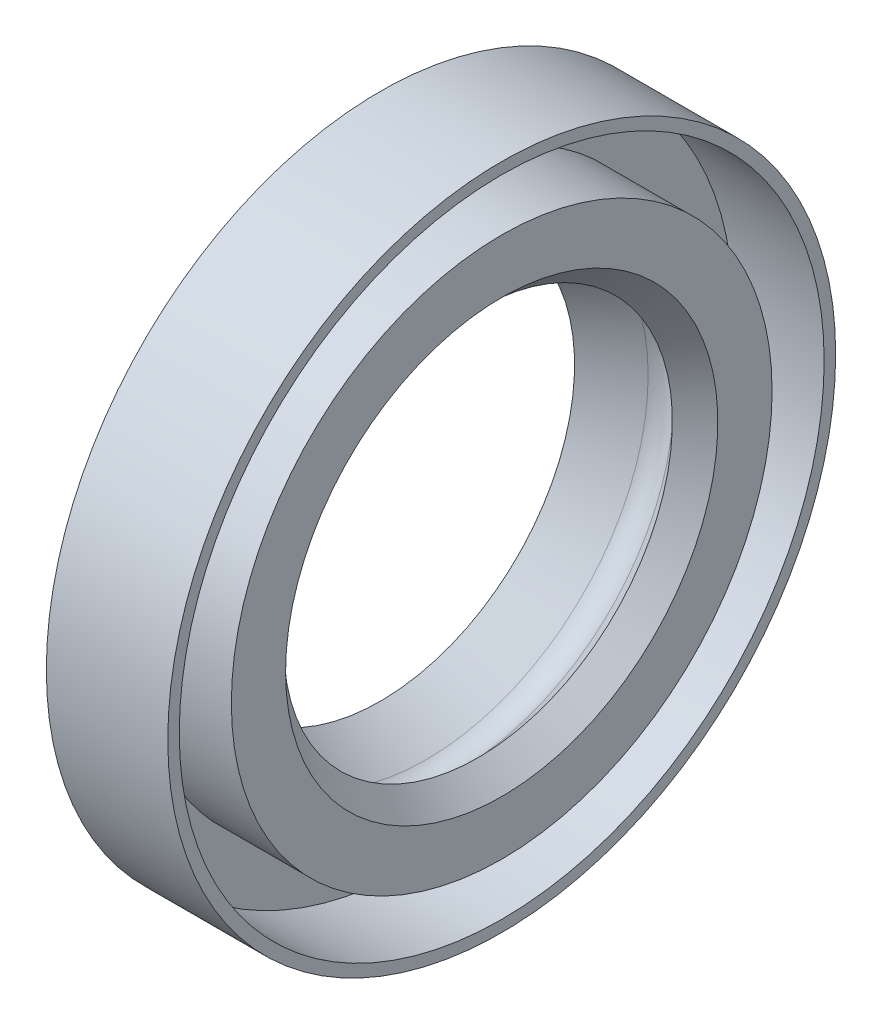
ISO-10303-21;
HEADER;
FILE_DESCRIPTION(('STEP AP214'),'2;1');
FILE_NAME('part.step','',(''),(''),'','','');
FILE_SCHEMA(('AUTOMOTIVE_DESIGN { 1 0 10303 214 1 1 1 1 }'));
ENDSEC;
DATA;
#1=APPLICATION_CONTEXT('core data for automotive mechanical design processes');
#2=APPLICATION_PROTOCOL_DEFINITION('international standard','automotive_design',2000,#1);
#3=PRODUCT_CONTEXT('',#1,'mechanical');
#4=PRODUCT('Part','Part','',(#3));
#5=PRODUCT_RELATED_PRODUCT_CATEGORY('part','',(#4));
#6=PRODUCT_DEFINITION_FORMATION('','',#4);
#7=PRODUCT_DEFINITION_CONTEXT('part definition',#1,'design');
#8=PRODUCT_DEFINITION('design','',#6,#7);
#9=PRODUCT_DEFINITION_SHAPE('','',#8);
#10=(LENGTH_UNIT() NAMED_UNIT(*) SI_UNIT(.MILLI.,.METRE.));
#11=(NAMED_UNIT(*) PLANE_ANGLE_UNIT() SI_UNIT($,.RADIAN.));
#12=(NAMED_UNIT(*) SI_UNIT($,.STERADIAN.) SOLID_ANGLE_UNIT());
#13=UNCERTAINTY_MEASURE_WITH_UNIT(LENGTH_MEASURE(1.E-05),#10,'distance_accuracy_value','');
#14=(GEOMETRIC_REPRESENTATION_CONTEXT(3) GLOBAL_UNCERTAINTY_ASSIGNED_CONTEXT((#13)) GLOBAL_UNIT_ASSIGNED_CONTEXT((#10,
#11,#12)) REPRESENTATION_CONTEXT('',''));
#15=CARTESIAN_POINT('',(0.,0.,0.));
#16=DIRECTION('',(0.,0.,1.));
#17=DIRECTION('',(1.,0.,0.));
#18=AXIS2_PLACEMENT_3D('',#15,#16,#17);
#19=CARTESIAN_POINT('',(4.81312504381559,0.,0.));
#20=DIRECTION('',(-1.,0.,0.));
#21=DIRECTION('',(0.,0.,1.));
#22=AXIS2_PLACEMENT_3D('',#19,#20,#21);
#23=TOROIDAL_SURFACE('',#22,16.5600277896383,2.);
#24=CARTESIAN_POINT('',(6.28210497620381,0.,0.));
#25=DIRECTION('',(-1.,0.,0.));
#26=DIRECTION('',(0.,0.,1.));
#27=AXIS2_PLACEMENT_3D('',#24,#25,#26);
#28=CIRCLE('',#27,17.9172668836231);
#29=CARTESIAN_POINT('',(6.28210497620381,0.,17.9172668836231));
#30=VERTEX_POINT('',#29);
#31=EDGE_CURVE('E10',#30,#30,#28,.T.);
#32=ORIENTED_EDGE('',*,*,#31,.F.);
#33=EDGE_LOOP('',(#32));
#34=FACE_BOUND('',#33,.T.);
#35=CARTESIAN_POINT('',(3.78262368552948,0.,0.));
#36=DIRECTION('',(-1.,0.,0.));
#37=DIRECTION('',(0.,0.,1.));
#38=AXIS2_PLACEMENT_3D('',#35,#36,#37);
#39=CIRCLE('',#38,18.274106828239);
#40=CARTESIAN_POINT('',(3.78262368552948,0.,18.274106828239));
#41=VERTEX_POINT('',#40);
#42=EDGE_CURVE('E72',#41,#41,#39,.T.);
#43=ORIENTED_EDGE('',*,*,#42,.T.);
#44=EDGE_LOOP('',(#43));
#45=FACE_BOUND('',#44,.T.);
#46=ADVANCED_FACE('F29',(#34,#45),#23,.F.);
#47=CARTESIAN_POINT('',(6.28210497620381,0.,0.));
#48=DIRECTION('',(-1.,0.,0.));
#49=DIRECTION('',(0.,0.,1.));
#50=AXIS2_PLACEMENT_3D('',#47,#48,#49);
#51=CONICAL_SURFACE('',#50,17.9172668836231,0.82491479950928);
#52=CARTESIAN_POINT('',(8.05353119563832,0.,0.));
#53=DIRECTION('',(-1.,0.,0.));
#54=DIRECTION('',(0.,0.,1.));
#55=AXIS2_PLACEMENT_3D('',#52,#53,#54);
#56=CIRCLE('',#55,16.);
#57=CARTESIAN_POINT('',(8.05353119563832,0.,16.));
#58=VERTEX_POINT('',#57);
#59=EDGE_CURVE('E35',#58,#58,#56,.T.);
#60=ORIENTED_EDGE('',*,*,#59,.F.);
#61=EDGE_LOOP('',(#60));
#62=FACE_BOUND('',#61,.T.);
#63=ORIENTED_EDGE('',*,*,#31,.T.);
#64=EDGE_LOOP('',(#63));
#65=FACE_BOUND('',#64,.T.);
#66=ADVANCED_FACE('F139',(#62,#65),#51,.F.);
#67=CARTESIAN_POINT('',(8.05353119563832,0.,0.));
#68=DIRECTION('',(1.,0.,0.));
#69=DIRECTION('',(0.,0.,-1.));
#70=AXIS2_PLACEMENT_3D('',#67,#68,#69);
#71=CONICAL_SURFACE('',#70,16.,0.745881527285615);
#72=CARTESIAN_POINT('',(10.,0.,0.));
#73=DIRECTION('',(-1.,0.,0.));
#74=DIRECTION('',(0.,0.,1.));
#75=AXIS2_PLACEMENT_3D('',#72,#73,#74);
#76=CIRCLE('',#75,17.7984068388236);
#77=CARTESIAN_POINT('',(10.,0.,17.7984068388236));
#78=VERTEX_POINT('',#77);
#79=EDGE_CURVE('E39',#78,#78,#76,.T.);
#80=ORIENTED_EDGE('',*,*,#79,.F.);
#81=EDGE_LOOP('',(#80));
#82=FACE_BOUND('',#81,.T.);
#83=ORIENTED_EDGE('',*,*,#59,.T.);
#84=EDGE_LOOP('',(#83));
#85=FACE_BOUND('',#84,.T.);
#86=ADVANCED_FACE('F134',(#82,#85),#71,.F.);
#87=CARTESIAN_POINT('',(10.,17.7984068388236,0.));
#88=DIRECTION('',(-1.,0.,0.));
#89=DIRECTION('',(0.,0.,1.));
#90=AXIS2_PLACEMENT_3D('',#87,#88,#89);
#91=PLANE('',#90);
#92=CARTESIAN_POINT('',(10.,0.,0.));
#93=DIRECTION('',(-1.,0.,0.));
#94=DIRECTION('',(0.,0.,1.));
#95=AXIS2_PLACEMENT_3D('',#92,#93,#94);
#96=CIRCLE('',#95,22.2647763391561);
#97=CARTESIAN_POINT('',(10.,0.,22.2647763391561));
#98=VERTEX_POINT('',#97);
#99=EDGE_CURVE('E43',#98,#98,#96,.T.);
#100=ORIENTED_EDGE('',*,*,#99,.F.);
#101=EDGE_LOOP('',(#100));
#102=FACE_BOUND('',#101,.T.);
#103=ORIENTED_EDGE('',*,*,#79,.T.);
#104=EDGE_LOOP('',(#103));
#105=FACE_BOUND('',#104,.T.);
#106=ADVANCED_FACE('F128',(#102,#105),#91,.F.);
#107=CARTESIAN_POINT('',(-2.05315418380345,0.,0.));
#108=DIRECTION('',(-1.,0.,0.));
#109=DIRECTION('',(0.,0.,1.));
#110=AXIS2_PLACEMENT_3D('',#107,#108,#109);
#111=CYLINDRICAL_SURFACE('',#110,22.2647763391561);
#112=CARTESIAN_POINT('',(2.5,0.,0.));
#113=DIRECTION('',(-1.,0.,0.));
#114=DIRECTION('',(0.,0.,1.));
#115=AXIS2_PLACEMENT_3D('',#112,#113,#114);
#116=CIRCLE('',#115,22.2647763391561);
#117=CARTESIAN_POINT('',(2.5,0.,22.2647763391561));
#118=VERTEX_POINT('',#117);
#119=EDGE_CURVE('E48',#118,#118,#116,.T.);
#120=ORIENTED_EDGE('',*,*,#119,.F.);
#121=EDGE_LOOP('',(#120));
#122=FACE_BOUND('',#121,.T.);
#123=ORIENTED_EDGE('',*,*,#99,.T.);
#124=EDGE_LOOP('',(#123));
#125=FACE_BOUND('',#124,.T.);
#126=ADVANCED_FACE('F122',(#122,#125),#111,.T.);
#127=CARTESIAN_POINT('',(2.5,22.2647763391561,0.));
#128=DIRECTION('',(-1.,0.,0.));
#129=DIRECTION('',(0.,0.,1.));
#130=AXIS2_PLACEMENT_3D('',#127,#128,#129);
#131=PLANE('',#130);
#132=CARTESIAN_POINT('',(2.5,0.,0.));
#133=DIRECTION('',(-1.,0.,0.));
#134=DIRECTION('',(0.,0.,1.));
#135=AXIS2_PLACEMENT_3D('',#132,#133,#134);
#136=CIRCLE('',#135,26.5533040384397);
#137=CARTESIAN_POINT('',(2.5,0.,26.5533040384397));
#138=VERTEX_POINT('',#137);
#139=EDGE_CURVE('E51',#138,#138,#136,.T.);
#140=ORIENTED_EDGE('',*,*,#139,.F.);
#141=EDGE_LOOP('',(#140));
#142=FACE_BOUND('',#141,.T.);
#143=ORIENTED_EDGE('',*,*,#119,.T.);
#144=EDGE_LOOP('',(#143));
#145=FACE_BOUND('',#144,.T.);
#146=ADVANCED_FACE('F116',(#142,#145),#131,.F.);
#147=CARTESIAN_POINT('',(-2.05315418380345,0.,0.));
#148=DIRECTION('',(-1.,0.,0.));
#149=DIRECTION('',(0.,0.,1.));
#150=AXIS2_PLACEMENT_3D('',#147,#148,#149);
#151=CYLINDRICAL_SURFACE('',#150,26.5533040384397);
#152=CARTESIAN_POINT('',(10.,0.,0.));
#153=DIRECTION('',(-1.,0.,0.));
#154=DIRECTION('',(0.,0.,1.));
#155=AXIS2_PLACEMENT_3D('',#152,#153,#154);
#156=CIRCLE('',#155,26.5533040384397);
#157=CARTESIAN_POINT('',(10.,0.,26.5533040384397));
#158=VERTEX_POINT('',#157);
#159=EDGE_CURVE('E54',#158,#158,#156,.T.);
#160=ORIENTED_EDGE('',*,*,#159,.F.);
#161=EDGE_LOOP('',(#160));
#162=FACE_BOUND('',#161,.T.);
#163=ORIENTED_EDGE('',*,*,#139,.T.);
#164=EDGE_LOOP('',(#163));
#165=FACE_BOUND('',#164,.T.);
#166=ADVANCED_FACE('F110',(#162,#165),#151,.F.);
#167=CARTESIAN_POINT('',(10.,27.5,0.));
#168=DIRECTION('',(-1.,0.,0.));
#169=DIRECTION('',(0.,0.,1.));
#170=AXIS2_PLACEMENT_3D('',#167,#168,#169);
#171=PLANE('',#170);
#172=CARTESIAN_POINT('',(10.,0.,0.));
#173=DIRECTION('',(-1.,0.,0.));
#174=DIRECTION('',(0.,0.,1.));
#175=AXIS2_PLACEMENT_3D('',#172,#173,#174);
#176=CIRCLE('',#175,27.5);
#177=CARTESIAN_POINT('',(10.,0.,27.5));
#178=VERTEX_POINT('',#177);
#179=EDGE_CURVE('E57',#178,#178,#176,.T.);
#180=ORIENTED_EDGE('',*,*,#179,.F.);
#181=EDGE_LOOP('',(#180));
#182=FACE_BOUND('',#181,.T.);
#183=ORIENTED_EDGE('',*,*,#159,.T.);
#184=EDGE_LOOP('',(#183));
#185=FACE_BOUND('',#184,.T.);
#186=ADVANCED_FACE('F104',(#182,#185),#171,.F.);
#187=CARTESIAN_POINT('',(-2.05315418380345,0.,0.));
#188=DIRECTION('',(-1.,0.,0.));
#189=DIRECTION('',(0.,0.,1.));
#190=AXIS2_PLACEMENT_3D('',#187,#188,#189);
#191=CYLINDRICAL_SURFACE('',#190,27.5);
#192=CARTESIAN_POINT('',(0.,0.,0.));
#193=DIRECTION('',(-1.,0.,0.));
#194=DIRECTION('',(0.,0.,1.));
#195=AXIS2_PLACEMENT_3D('',#192,#193,#194);
#196=CIRCLE('',#195,27.5);
#197=CARTESIAN_POINT('',(0.,0.,27.5));
#198=VERTEX_POINT('',#197);
#199=EDGE_CURVE('E60',#198,#198,#196,.T.);
#200=ORIENTED_EDGE('',*,*,#199,.F.);
#201=EDGE_LOOP('',(#200));
#202=FACE_BOUND('',#201,.T.);
#203=ORIENTED_EDGE('',*,*,#179,.T.);
#204=EDGE_LOOP('',(#203));
#205=FACE_BOUND('',#204,.T.);
#206=ADVANCED_FACE('F98',(#202,#205),#191,.T.);
#207=CARTESIAN_POINT('',(0.,19.5412068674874,0.));
#208=DIRECTION('',(1.,0.,0.));
#209=DIRECTION('',(0.,0.,-1.));
#210=AXIS2_PLACEMENT_3D('',#207,#208,#209);
#211=PLANE('',#210);
#212=CARTESIAN_POINT('',(0.,0.,0.));
#213=DIRECTION('',(-1.,0.,0.));
#214=DIRECTION('',(0.,0.,1.));
#215=AXIS2_PLACEMENT_3D('',#212,#213,#214);
#216=CIRCLE('',#215,19.5412068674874);
#217=CARTESIAN_POINT('',(0.,0.,19.5412068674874));
#218=VERTEX_POINT('',#217);
#219=EDGE_CURVE('E63',#218,#218,#216,.T.);
#220=ORIENTED_EDGE('',*,*,#219,.F.);
#221=EDGE_LOOP('',(#220));
#222=FACE_BOUND('',#221,.T.);
#223=ORIENTED_EDGE('',*,*,#199,.T.);
#224=EDGE_LOOP('',(#223));
#225=FACE_BOUND('',#224,.T.);
#226=ADVANCED_FACE('F92',(#222,#225),#211,.F.);
#227=CARTESIAN_POINT('',(0.,0.,0.));
#228=DIRECTION('',(-1.,0.,0.));
#229=DIRECTION('',(0.,0.,1.));
#230=AXIS2_PLACEMENT_3D('',#227,#228,#229);
#231=CONICAL_SURFACE('',#230,19.5412068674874,1.13319753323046);
#232=CARTESIAN_POINT('',(0.828215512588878,0.,0.));
#233=DIRECTION('',(-1.,0.,0.));
#234=DIRECTION('',(0.,0.,1.));
#235=AXIS2_PLACEMENT_3D('',#232,#233,#234);
#236=CIRCLE('',#235,17.770949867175);
#237=CARTESIAN_POINT('',(0.828215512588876,0.,17.770949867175));
#238=VERTEX_POINT('',#237);
#239=EDGE_CURVE('E66',#238,#238,#236,.T.);
#240=ORIENTED_EDGE('',*,*,#239,.F.);
#241=EDGE_LOOP('',(#240));
#242=FACE_BOUND('',#241,.T.);
#243=ORIENTED_EDGE('',*,*,#219,.T.);
#244=EDGE_LOOP('',(#243));
#245=FACE_BOUND('',#244,.T.);
#246=ADVANCED_FACE('F86',(#242,#245),#231,.F.);
#247=CARTESIAN_POINT('',(0.828215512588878,0.,0.));
#248=DIRECTION('',(1.,0.,0.));
#249=DIRECTION('',(0.,0.,-1.));
#250=AXIS2_PLACEMENT_3D('',#247,#248,#249);
#251=CONICAL_SURFACE('',#250,17.770949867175,1.13334771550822);
#252=CARTESIAN_POINT('',(0.,0.,0.));
#253=DIRECTION('',(-1.,0.,0.));
#254=DIRECTION('',(0.,0.,1.));
#255=AXIS2_PLACEMENT_3D('',#252,#253,#254);
#256=CIRCLE('',#255,16.);
#257=CARTESIAN_POINT('',(0.,0.,16.));
#258=VERTEX_POINT('',#257);
#259=EDGE_CURVE('E69',#258,#258,#256,.T.);
#260=ORIENTED_EDGE('',*,*,#259,.F.);
#261=EDGE_LOOP('',(#260));
#262=FACE_BOUND('',#261,.T.);
#263=ORIENTED_EDGE('',*,*,#239,.T.);
#264=EDGE_LOOP('',(#263));
#265=FACE_BOUND('',#264,.T.);
#266=ADVANCED_FACE('F80',(#262,#265),#251,.T.);
#267=CARTESIAN_POINT('',(0.,0.,0.));
#268=DIRECTION('',(1.,0.,0.));
#269=DIRECTION('',(0.,0.,-1.));
#270=AXIS2_PLACEMENT_3D('',#267,#268,#269);
#271=CONICAL_SURFACE('',#270,16.,0.541300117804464);
#272=ORIENTED_EDGE('',*,*,#42,.F.);
#273=EDGE_LOOP('',(#272));
#274=FACE_BOUND('',#273,.T.);
#275=ORIENTED_EDGE('',*,*,#259,.T.);
#276=EDGE_LOOP('',(#275));
#277=FACE_BOUND('',#276,.T.);
#278=ADVANCED_FACE('F77',(#274,#277),#271,.F.);
#279=CLOSED_SHELL('',(#46,#66,#86,#106,#126,#146,#166,#186,#206,#226,#246,#266,#278));
#280=MANIFOLD_SOLID_BREP('B2',#279);
#281=ADVANCED_BREP_SHAPE_REPRESENTATION('',(#18,#280),#14);
#282=SHAPE_DEFINITION_REPRESENTATION(#9,#281);
ENDSEC;
END-ISO-10303-21;
